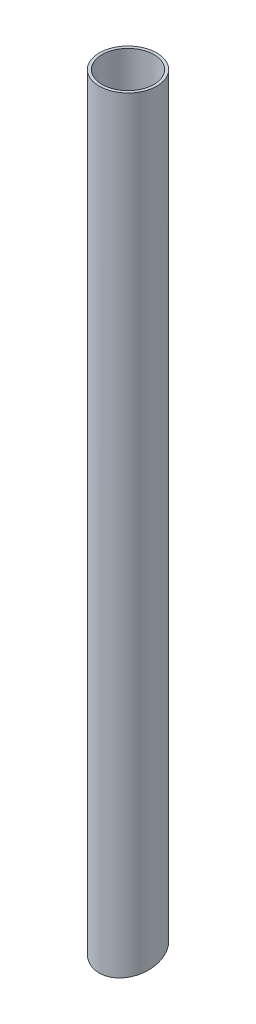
ISO-10303-21;
HEADER;
FILE_DESCRIPTION(('STEP AP214'),'2;1');
FILE_NAME('part.step','',(''),(''),'','','');
FILE_SCHEMA(('AUTOMOTIVE_DESIGN { 1 0 10303 214 1 1 1 1 }'));
ENDSEC;
DATA;
#1=APPLICATION_CONTEXT('core data for automotive mechanical design processes');
#2=APPLICATION_PROTOCOL_DEFINITION('international standard','automotive_design',2000,#1);
#3=PRODUCT_CONTEXT('',#1,'mechanical');
#4=PRODUCT('Part','Part','',(#3));
#5=PRODUCT_RELATED_PRODUCT_CATEGORY('part','',(#4));
#6=PRODUCT_DEFINITION_FORMATION('','',#4);
#7=PRODUCT_DEFINITION_CONTEXT('part definition',#1,'design');
#8=PRODUCT_DEFINITION('design','',#6,#7);
#9=PRODUCT_DEFINITION_SHAPE('','',#8);
#10=(LENGTH_UNIT() NAMED_UNIT(*) SI_UNIT(.MILLI.,.METRE.));
#11=(NAMED_UNIT(*) PLANE_ANGLE_UNIT() SI_UNIT($,.RADIAN.));
#12=(NAMED_UNIT(*) SI_UNIT($,.STERADIAN.) SOLID_ANGLE_UNIT());
#13=UNCERTAINTY_MEASURE_WITH_UNIT(LENGTH_MEASURE(1.E-05),#10,'distance_accuracy_value','');
#14=(GEOMETRIC_REPRESENTATION_CONTEXT(3) GLOBAL_UNCERTAINTY_ASSIGNED_CONTEXT((#13)) GLOBAL_UNIT_ASSIGNED_CONTEXT((#10,
#11,#12)) REPRESENTATION_CONTEXT('',''));
#15=CARTESIAN_POINT('',(0.,0.,0.));
#16=DIRECTION('',(0.,0.,1.));
#17=DIRECTION('',(1.,0.,0.));
#18=AXIS2_PLACEMENT_3D('',#15,#16,#17);
#19=CARTESIAN_POINT('',(0.,400.,0.));
#20=DIRECTION('',(0.,-1.,0.));
#21=DIRECTION('',(0.,0.,-1.));
#22=AXIS2_PLACEMENT_3D('',#19,#20,#21);
#23=CYLINDRICAL_SURFACE('',#22,15.);
#24=CARTESIAN_POINT('',(0.,400.,0.));
#25=DIRECTION('',(0.,1.,0.));
#26=DIRECTION('',(0.,0.,1.));
#27=AXIS2_PLACEMENT_3D('',#24,#25,#26);
#28=CIRCLE('',#27,15.);
#29=CARTESIAN_POINT('',(0.,400.,15.));
#30=VERTEX_POINT('',#29);
#31=EDGE_CURVE('E11',#30,#30,#28,.T.);
#32=ORIENTED_EDGE('',*,*,#31,.F.);
#33=EDGE_LOOP('',(#32));
#34=FACE_BOUND('',#33,.T.);
#35=CARTESIAN_POINT('',(0.,4.01923788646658,0.));
#36=DIRECTION('',(0.,-0.965925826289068,-0.258819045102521));
#37=DIRECTION('',(0.,-0.258819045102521,0.965925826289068));
#38=AXIS2_PLACEMENT_3D('',#35,#36,#37);
#39=ELLIPSE('',#38,15.5291427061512,15.);
#40=CARTESIAN_POINT('',(0.,-2.74086309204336E-13,15.));
#41=VERTEX_POINT('',#40);
#42=EDGE_CURVE('E48',#41,#41,#39,.T.);
#43=ORIENTED_EDGE('',*,*,#42,.F.);
#44=EDGE_LOOP('',(#43));
#45=FACE_BOUND('',#44,.T.);
#46=ADVANCED_FACE('F37',(#34,#45),#23,.T.);
#47=CARTESIAN_POINT('',(0.,400.,0.));
#48=DIRECTION('',(0.,-1.,0.));
#49=DIRECTION('',(0.,0.,-1.));
#50=AXIS2_PLACEMENT_3D('',#47,#48,#49);
#51=CYLINDRICAL_SURFACE('',#50,13.5);
#52=CARTESIAN_POINT('',(0.,400.,0.));
#53=DIRECTION('',(0.,1.,0.));
#54=DIRECTION('',(1.,0.,0.));
#55=AXIS2_PLACEMENT_3D('',#52,#53,#54);
#56=CIRCLE('',#55,13.5);
#57=CARTESIAN_POINT('',(13.5,400.,0.));
#58=VERTEX_POINT('',#57);
#59=EDGE_CURVE('E44',#58,#58,#56,.T.);
#60=ORIENTED_EDGE('',*,*,#59,.T.);
#61=EDGE_LOOP('',(#60));
#62=FACE_BOUND('',#61,.T.);
#63=CARTESIAN_POINT('',(0.,4.01923788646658,0.));
#64=DIRECTION('',(0.,-0.965925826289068,-0.258819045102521));
#65=DIRECTION('',(0.,-0.258819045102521,0.965925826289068));
#66=AXIS2_PLACEMENT_3D('',#63,#64,#65);
#67=ELLIPSE('',#66,13.9762284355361,13.5);
#68=CARTESIAN_POINT('',(0.,0.401923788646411,13.5));
#69=VERTEX_POINT('',#68);
#70=EDGE_CURVE('E40',#69,#69,#67,.T.);
#71=ORIENTED_EDGE('',*,*,#70,.T.);
#72=EDGE_LOOP('',(#71));
#73=FACE_BOUND('',#72,.T.);
#74=ADVANCED_FACE('F57',(#62,#73),#51,.F.);
#75=CARTESIAN_POINT('',(0.,400.,0.));
#76=DIRECTION('',(0.,1.,0.));
#77=DIRECTION('',(0.,0.,1.));
#78=AXIS2_PLACEMENT_3D('',#75,#76,#77);
#79=PLANE('',#78);
#80=ORIENTED_EDGE('',*,*,#31,.T.);
#81=EDGE_LOOP('',(#80));
#82=FACE_BOUND('',#81,.T.);
#83=ORIENTED_EDGE('',*,*,#59,.F.);
#84=EDGE_LOOP('',(#83));
#85=FACE_BOUND('',#84,.T.);
#86=ADVANCED_FACE('F61',(#82,#85),#79,.T.);
#87=CARTESIAN_POINT('',(502.804634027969,8.03847577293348,-15.0000000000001));
#88=DIRECTION('',(0.,-0.965925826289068,-0.258819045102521));
#89=DIRECTION('',(0.,0.258819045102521,-0.965925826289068));
#90=AXIS2_PLACEMENT_3D('',#87,#88,#89);
#91=PLANE('',#90);
#92=ORIENTED_EDGE('',*,*,#70,.F.);
#93=EDGE_LOOP('',(#92));
#94=FACE_BOUND('',#93,.T.);
#95=ORIENTED_EDGE('',*,*,#42,.T.);
#96=EDGE_LOOP('',(#95));
#97=FACE_BOUND('',#96,.T.);
#98=ADVANCED_FACE('F59',(#94,#97),#91,.T.);
#99=CLOSED_SHELL('',(#46,#74,#86,#98));
#100=MANIFOLD_SOLID_BREP('B2',#99);
#101=ADVANCED_BREP_SHAPE_REPRESENTATION('',(#18,#100),#14);
#102=SHAPE_DEFINITION_REPRESENTATION(#9,#101);
ENDSEC;
END-ISO-10303-21;
